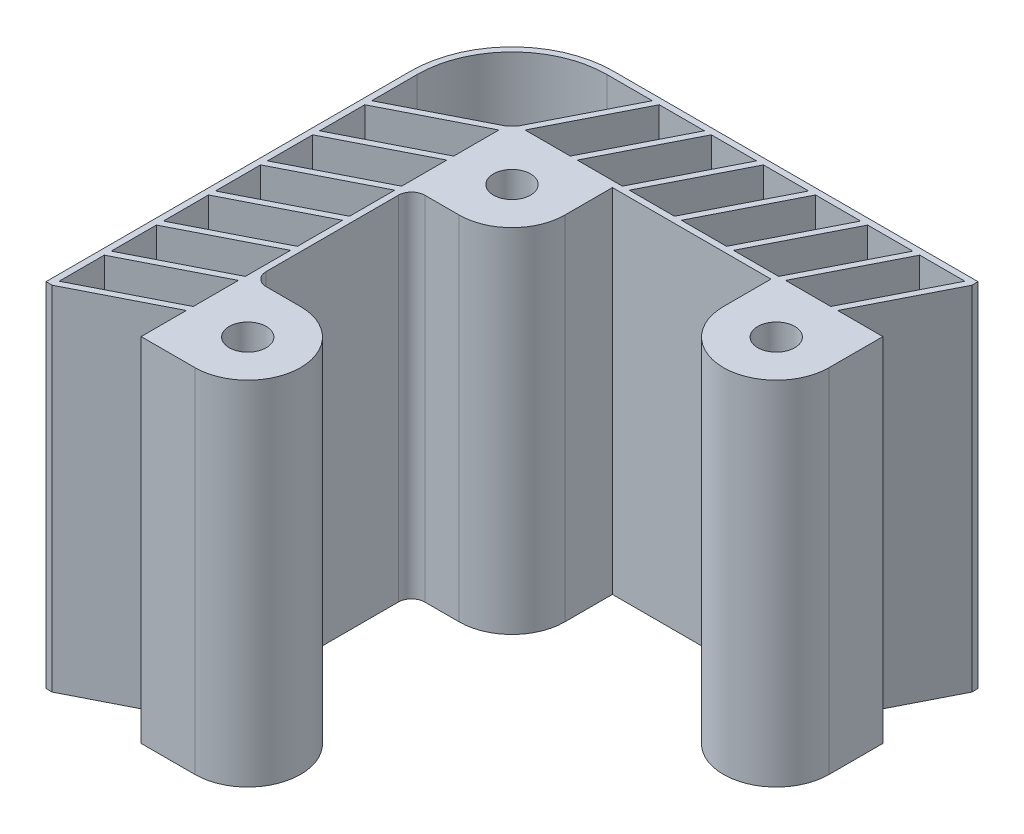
from build123d import *

# Parameters (mm, degrees)
SKETCH_1_R          = 2.1
EXTRUDE_1_DEPTH     = 40
FILLET_1_R          = 1.5
CUT_EXTRUDE_1_DEPTH = 65.745656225


with BuildPart() as part:
    # Sketch 1 → Extrude 1 (new body)
    with BuildSketch(Plane(origin=(0, 0, 0), x_dir=(1, 0, 0), z_dir=(0, 1, 0))):
        with BuildLine():
            Line((6, 0), (6, 5.4))
            Line((6, 5.4), (24, 5.4))
            Line((24, 5.4), (24, 0))
            ThreePointArc((24, 0), (30, -6), (36, 0))
            Line((36, 0), (36, 16.9))
            Line((36, 16.9), (-16.9, 16.9))
            Line((-16.9, 16.9), (-16.9, -36))
            Line((-16.9, -36), (0, -36))
            ThreePointArc((0, -36), (6, -30), (0, -24))
            Line((0, -24), (-5.4, -24))
            Line((-5.4, -24), (-5.4, -6))
            Line((-5.4, -6), (0, -6))
            ThreePointArc((0, -6), (4.242640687, -4.242640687), (6, 0))
        make_face()
        with Locations(Location((0, -30, 0), (0, 0, 270))):
            Circle(SKETCH_1_R, mode=Mode.SUBTRACT)
        with Locations(Location((0, 0, 0), (0, 0, 270))):
            Circle(SKETCH_1_R, mode=Mode.SUBTRACT)
        with Locations(Location((30, 0, 0), (0, 0, 270))):
            Circle(SKETCH_1_R, mode=Mode.SUBTRACT)
    extrude(amount=EXTRUDE_1_DEPTH)

    # Fillet 1
    fillet_1_edges = [part.edges().sort_by_distance(p)[0] for p in [
        (-5.4, 20, 6),
        (-5.4, 20, 24),
    ]]
    fillet(fillet_1_edges, radius=FILLET_1_R)

    # Sketch 2 → Cut-Extrude 1 (cut, through all)
    with BuildSketch(Plane(origin=(0, 40, 0), x_dir=(1, 0, 0), z_dir=(0, 1, 0))):
        with BuildLine():
            ThreePointArc((-16.2, 5.4), (-13.036753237, 13.036753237), (-5.4, 16.2))
            Line((-5.4, 16.2), (-0.270807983, 16.2))
            Line((-0.270807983, 16.2), (-5.4, 6.1))
            Line((-5.4, 6.1), (-6.1, 5.4))
            Line((-6.1, 5.4), (-16.2, 0.270807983))
            Line((-16.2, 0.270807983), (-16.2, 5.4))
        make_face()
        with BuildLine():
            Line((-16.9, 16.9), (-16.9, 5.4))
            ThreePointArc((-16.9, 5.4), (-13.531727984, 13.531727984), (-5.4, 16.9))
            Line((-5.4, 16.9), (-16.9, 16.9))
        make_face()
        Polygon((-16.2, -5.643477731), (-16.2, -0.514285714), (-6.1, 4.614906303), (-6.1, -0.514285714), align=None)
        Polygon((-16.2, -11.557763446), (-16.2, -6.428571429), (-6.1, -1.299379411), (-6.1, -6.428571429), align=None)
        Polygon((-16.2, -17.47204916), (-16.2, -12.342857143), (-6.1, -7.213665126), (-6.1, -12.342857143), align=None)
        Polygon((-16.2, -23.386334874), (-16.2, -18.257142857), (-6.1, -13.12795084), (-6.1, -18.257142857), align=None)
        Polygon((-16.2, -29.300620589), (-16.2, -24.171428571), (-6.1, -19.042236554), (-6.1, -24.171428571), align=None)
        Polygon((-16.2, -35.214906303), (-16.2, -30.085714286), (-6.1, -24.956522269), (-6.1, -30.085714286), align=None)
        Polygon((-6.1, -30.870807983), (-16.2, -36), (-6.1, -36), align=None)
        Polygon((5.643477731, 16.2), (0.514285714, 16.2), (-4.614906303, 6.1), (0.514285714, 6.1), align=None)
        Polygon((11.557763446, 16.2), (6.428571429, 16.2), (1.299379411, 6.1), (6.428571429, 6.1), align=None)
        Polygon((17.47204916, 16.2), (12.342857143, 16.2), (7.213665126, 6.1), (12.342857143, 6.1), align=None)
        Polygon((23.386334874, 16.2), (18.257142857, 16.2), (13.12795084, 6.1), (18.257142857, 6.1), align=None)
        Polygon((29.300620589, 16.2), (24.171428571, 16.2), (19.042236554, 6.1), (24.171428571, 6.1), align=None)
        Polygon((35.214906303, 16.2), (30.085714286, 16.2), (24.956522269, 6.1), (30.085714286, 6.1), align=None)
        Polygon((36, 6.1), (36, 16.2), (30.870807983, 6.1), align=None)
    extrude(amount=-CUT_EXTRUDE_1_DEPTH, mode=Mode.SUBTRACT)


solid = part.part
